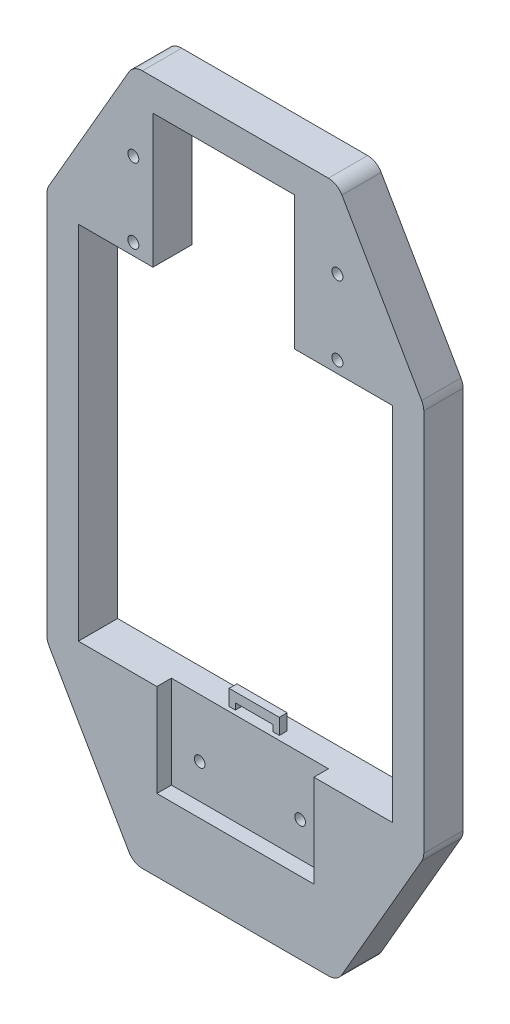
ISO-10303-21;
HEADER;
FILE_DESCRIPTION(('STEP AP214'),'2;1');
FILE_NAME('part.step','',(''),(''),'','','');
FILE_SCHEMA(('AUTOMOTIVE_DESIGN { 1 0 10303 214 1 1 1 1 }'));
ENDSEC;
DATA;
#1=APPLICATION_CONTEXT('core data for automotive mechanical design processes');
#2=APPLICATION_PROTOCOL_DEFINITION('international standard','automotive_design',2000,#1);
#3=PRODUCT_CONTEXT('',#1,'mechanical');
#4=PRODUCT('Part','Part','',(#3));
#5=PRODUCT_RELATED_PRODUCT_CATEGORY('part','',(#4));
#6=PRODUCT_DEFINITION_FORMATION('','',#4);
#7=PRODUCT_DEFINITION_CONTEXT('part definition',#1,'design');
#8=PRODUCT_DEFINITION('design','',#6,#7);
#9=PRODUCT_DEFINITION_SHAPE('','',#8);
#10=(LENGTH_UNIT() NAMED_UNIT(*) SI_UNIT(.MILLI.,.METRE.));
#11=(NAMED_UNIT(*) PLANE_ANGLE_UNIT() SI_UNIT($,.RADIAN.));
#12=(NAMED_UNIT(*) SI_UNIT($,.STERADIAN.) SOLID_ANGLE_UNIT());
#13=UNCERTAINTY_MEASURE_WITH_UNIT(LENGTH_MEASURE(1.E-05),#10,'distance_accuracy_value','');
#14=(GEOMETRIC_REPRESENTATION_CONTEXT(3) GLOBAL_UNCERTAINTY_ASSIGNED_CONTEXT((#13)) GLOBAL_UNIT_ASSIGNED_CONTEXT((#10,
#11,#12)) REPRESENTATION_CONTEXT('',''));
#15=CARTESIAN_POINT('',(0.,0.,0.));
#16=DIRECTION('',(0.,0.,1.));
#17=DIRECTION('',(1.,0.,0.));
#18=AXIS2_PLACEMENT_3D('',#15,#16,#17);
#19=CARTESIAN_POINT('',(-118.660254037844,127.025650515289,30.));
#20=DIRECTION('',(0.866025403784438,-0.500000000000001,0.));
#21=DIRECTION('',(0.500000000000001,0.866025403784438,0.));
#22=AXIS2_PLACEMENT_3D('',#19,#20,#21);
#23=PLANE('',#22);
#24=DIRECTION('',(0.500000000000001,0.866025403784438,0.));
#25=VECTOR('',#24,1.);
#26=CARTESIAN_POINT('',(-118.660254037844,127.025650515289,4.99999999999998));
#27=LINE('',#26,#25);
#28=CARTESIAN_POINT('',(-118.660254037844,127.025650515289,5.));
#29=VERTEX_POINT('',#28);
#30=CARTESIAN_POINT('',(-67.8682396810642,215.,5.));
#31=VERTEX_POINT('',#30);
#32=EDGE_CURVE('E467',#29,#31,#27,.T.);
#33=ORIENTED_EDGE('',*,*,#32,.F.);
#34=DIRECTION('',(0.,0.,-1.));
#35=VECTOR('',#34,1.);
#36=CARTESIAN_POINT('',(-118.660254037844,127.025650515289,30.));
#37=LINE('',#36,#35);
#38=CARTESIAN_POINT('',(-118.660254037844,127.025650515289,30.));
#39=VERTEX_POINT('',#38);
#40=EDGE_CURVE('E581',#39,#29,#37,.T.);
#41=ORIENTED_EDGE('',*,*,#40,.F.);
#42=DIRECTION('',(-0.500000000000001,-0.866025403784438,0.));
#43=VECTOR('',#42,1.);
#44=CARTESIAN_POINT('',(-118.660254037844,127.025650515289,30.));
#45=LINE('',#44,#43);
#46=CARTESIAN_POINT('',(-67.8682396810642,215.,30.));
#47=VERTEX_POINT('',#46);
#48=EDGE_CURVE('E564',#47,#39,#45,.T.);
#49=ORIENTED_EDGE('',*,*,#48,.F.);
#50=DIRECTION('',(0.,0.,-1.));
#51=VECTOR('',#50,1.);
#52=CARTESIAN_POINT('',(-67.8682396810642,215.,30.));
#53=LINE('',#52,#51);
#54=EDGE_CURVE('E585',#47,#31,#53,.T.);
#55=ORIENTED_EDGE('',*,*,#54,.T.);
#56=EDGE_LOOP('',(#33,#41,#49,#55));
#57=FACE_BOUND('',#56,.T.);
#58=ADVANCED_FACE('F43',(#57),#23,.F.);
#59=CARTESIAN_POINT('',(-110.,-122.025650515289,30.));
#60=DIRECTION('',(0.,0.,-1.));
#61=DIRECTION('',(-1.,0.,0.));
#62=AXIS2_PLACEMENT_3D('',#59,#60,#61);
#63=CYLINDRICAL_SURFACE('',#62,9.99999999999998);
#64=CARTESIAN_POINT('',(-110.,-122.025650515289,5.));
#65=DIRECTION('',(0.,0.,-1.));
#66=DIRECTION('',(-1.,0.,0.));
#67=AXIS2_PLACEMENT_3D('',#64,#65,#66);
#68=CIRCLE('',#67,9.99999999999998);
#69=CARTESIAN_POINT('',(-118.660254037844,-127.025650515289,5.));
#70=VERTEX_POINT('',#69);
#71=CARTESIAN_POINT('',(-120.,-122.025650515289,5.));
#72=VERTEX_POINT('',#71);
#73=EDGE_CURVE('E723',#70,#72,#68,.T.);
#74=ORIENTED_EDGE('',*,*,#73,.F.);
#75=DIRECTION('',(0.,0.,-1.));
#76=VECTOR('',#75,1.);
#77=CARTESIAN_POINT('',(-118.660254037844,-127.025650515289,30.));
#78=LINE('',#77,#76);
#79=CARTESIAN_POINT('',(-118.660254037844,-127.025650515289,30.));
#80=VERTEX_POINT('',#79);
#81=EDGE_CURVE('E633',#80,#70,#78,.T.);
#82=ORIENTED_EDGE('',*,*,#81,.F.);
#83=CARTESIAN_POINT('',(-110.,-122.025650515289,30.));
#84=DIRECTION('',(0.,0.,1.));
#85=DIRECTION('',(-1.,0.,0.));
#86=AXIS2_PLACEMENT_3D('',#83,#84,#85);
#87=CIRCLE('',#86,9.99999999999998);
#88=CARTESIAN_POINT('',(-120.,-122.025650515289,30.));
#89=VERTEX_POINT('',#88);
#90=EDGE_CURVE('E524',#89,#80,#87,.T.);
#91=ORIENTED_EDGE('',*,*,#90,.F.);
#92=DIRECTION('',(0.,0.,-1.));
#93=VECTOR('',#92,1.);
#94=CARTESIAN_POINT('',(-120.,-122.025650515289,30.));
#95=LINE('',#94,#93);
#96=EDGE_CURVE('E573',#89,#72,#95,.T.);
#97=ORIENTED_EDGE('',*,*,#96,.T.);
#98=EDGE_LOOP('',(#74,#82,#91,#97));
#99=FACE_BOUND('',#98,.T.);
#100=ADVANCED_FACE('F45',(#99),#63,.T.);
#101=CARTESIAN_POINT('',(-118.660254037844,-127.025650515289,30.));
#102=DIRECTION('',(0.866025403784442,0.499999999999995,0.));
#103=DIRECTION('',(-0.499999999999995,0.866025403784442,0.));
#104=AXIS2_PLACEMENT_3D('',#101,#102,#103);
#105=PLANE('',#104);
#106=ORIENTED_EDGE('',*,*,#81,.T.);
#107=DIRECTION('',(0.499999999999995,-0.866025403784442,0.));
#108=VECTOR('',#107,1.);
#109=CARTESIAN_POINT('',(-118.660254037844,-127.025650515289,4.99999999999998));
#110=LINE('',#109,#108);
#111=CARTESIAN_POINT('',(-67.8682396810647,-215.,5.));
#112=VERTEX_POINT('',#111);
#113=EDGE_CURVE('E422',#70,#112,#110,.T.);
#114=ORIENTED_EDGE('',*,*,#113,.T.);
#115=DIRECTION('',(0.,0.,-1.));
#116=VECTOR('',#115,1.);
#117=CARTESIAN_POINT('',(-67.8682396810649,-215.,30.));
#118=LINE('',#117,#116);
#119=CARTESIAN_POINT('',(-67.8682396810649,-215.,30.));
#120=VERTEX_POINT('',#119);
#121=EDGE_CURVE('E629',#120,#112,#118,.T.);
#122=ORIENTED_EDGE('',*,*,#121,.F.);
#123=DIRECTION('',(0.499999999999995,-0.866025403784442,0.));
#124=VECTOR('',#123,1.);
#125=CARTESIAN_POINT('',(-118.660254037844,-127.025650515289,30.));
#126=LINE('',#125,#124);
#127=EDGE_CURVE('E528',#80,#120,#126,.T.);
#128=ORIENTED_EDGE('',*,*,#127,.F.);
#129=EDGE_LOOP('',(#106,#114,#122,#128));
#130=FACE_BOUND('',#129,.T.);
#131=ADVANCED_FACE('F902',(#130),#105,.F.);
#132=CARTESIAN_POINT('',(-110.,122.025650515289,30.));
#133=DIRECTION('',(0.,0.,-1.));
#134=DIRECTION('',(-1.,0.,0.));
#135=AXIS2_PLACEMENT_3D('',#132,#133,#134);
#136=CYLINDRICAL_SURFACE('',#135,10.);
#137=CARTESIAN_POINT('',(-110.,122.025650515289,5.));
#138=DIRECTION('',(0.,0.,-1.));
#139=DIRECTION('',(-1.,0.,0.));
#140=AXIS2_PLACEMENT_3D('',#137,#138,#139);
#141=CIRCLE('',#140,10.);
#142=CARTESIAN_POINT('',(-120.,122.025650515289,5.));
#143=VERTEX_POINT('',#142);
#144=EDGE_CURVE('E716',#143,#29,#141,.T.);
#145=ORIENTED_EDGE('',*,*,#144,.F.);
#146=DIRECTION('',(0.,0.,-1.));
#147=VECTOR('',#146,1.);
#148=CARTESIAN_POINT('',(-120.,122.025650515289,30.));
#149=LINE('',#148,#147);
#150=CARTESIAN_POINT('',(-120.,122.025650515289,30.));
#151=VERTEX_POINT('',#150);
#152=EDGE_CURVE('E577',#151,#143,#149,.T.);
#153=ORIENTED_EDGE('',*,*,#152,.F.);
#154=CARTESIAN_POINT('',(-110.,122.025650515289,30.));
#155=DIRECTION('',(0.,0.,1.));
#156=DIRECTION('',(1.,0.,0.));
#157=AXIS2_PLACEMENT_3D('',#154,#155,#156);
#158=CIRCLE('',#157,10.);
#159=EDGE_CURVE('E567',#39,#151,#158,.T.);
#160=ORIENTED_EDGE('',*,*,#159,.F.);
#161=ORIENTED_EDGE('',*,*,#40,.T.);
#162=EDGE_LOOP('',(#145,#153,#160,#161));
#163=FACE_BOUND('',#162,.T.);
#164=ADVANCED_FACE('F906',(#163),#136,.T.);
#165=CARTESIAN_POINT('',(-120.,122.025650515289,30.));
#166=DIRECTION('',(1.,0.,0.));
#167=DIRECTION('',(0.,1.,0.));
#168=AXIS2_PLACEMENT_3D('',#165,#166,#167);
#169=PLANE('',#168);
#170=DIRECTION('',(0.,1.,0.));
#171=VECTOR('',#170,1.);
#172=CARTESIAN_POINT('',(-120.,122.025650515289,5.));
#173=LINE('',#172,#171);
#174=EDGE_CURVE('E720',#72,#143,#173,.T.);
#175=ORIENTED_EDGE('',*,*,#174,.F.);
#176=ORIENTED_EDGE('',*,*,#96,.F.);
#177=DIRECTION('',(0.,-1.,0.));
#178=VECTOR('',#177,1.);
#179=CARTESIAN_POINT('',(-120.,122.025650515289,30.));
#180=LINE('',#179,#178);
#181=EDGE_CURVE('E570',#151,#89,#180,.T.);
#182=ORIENTED_EDGE('',*,*,#181,.F.);
#183=ORIENTED_EDGE('',*,*,#152,.T.);
#184=EDGE_LOOP('',(#175,#176,#182,#183));
#185=FACE_BOUND('',#184,.T.);
#186=ADVANCED_FACE('F956',(#185),#169,.F.);
#187=CARTESIAN_POINT('',(37.5,200.,-10.));
#188=DIRECTION('',(1.,0.,0.));
#189=DIRECTION('',(0.,1.,0.));
#190=AXIS2_PLACEMENT_3D('',#187,#188,#189);
#191=PLANE('',#190);
#192=DIRECTION('',(0.,1.,0.));
#193=VECTOR('',#192,1.);
#194=CARTESIAN_POINT('',(37.5,200.,5.));
#195=LINE('',#194,#193);
#196=CARTESIAN_POINT('',(37.5,115.,5.));
#197=VERTEX_POINT('',#196);
#198=CARTESIAN_POINT('',(37.5,200.,5.));
#199=VERTEX_POINT('',#198);
#200=EDGE_CURVE('E733',#197,#199,#195,.T.);
#201=ORIENTED_EDGE('',*,*,#200,.F.);
#202=DIRECTION('',(0.,0.,1.));
#203=VECTOR('',#202,1.);
#204=CARTESIAN_POINT('',(37.5,115.,-10.));
#205=LINE('',#204,#203);
#206=CARTESIAN_POINT('',(37.5,115.,30.));
#207=VERTEX_POINT('',#206);
#208=EDGE_CURVE('E495',#197,#207,#205,.T.);
#209=ORIENTED_EDGE('',*,*,#208,.T.);
#210=DIRECTION('',(0.,1.,0.));
#211=VECTOR('',#210,1.);
#212=CARTESIAN_POINT('',(37.5,200.,30.));
#213=LINE('',#212,#211);
#214=CARTESIAN_POINT('',(37.5,200.,30.));
#215=VERTEX_POINT('',#214);
#216=EDGE_CURVE('E487',#207,#215,#213,.T.);
#217=ORIENTED_EDGE('',*,*,#216,.T.);
#218=DIRECTION('',(0.,0.,1.));
#219=VECTOR('',#218,1.);
#220=CARTESIAN_POINT('',(37.5,200.,30.));
#221=LINE('',#220,#219);
#222=EDGE_CURVE('E52',#199,#215,#221,.T.);
#223=ORIENTED_EDGE('',*,*,#222,.F.);
#224=EDGE_LOOP('',(#201,#209,#217,#223));
#225=FACE_BOUND('',#224,.T.);
#226=ADVANCED_FACE('F774',(#225),#191,.F.);
#227=CARTESIAN_POINT('',(47.6609802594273,200.,30.));
#228=DIRECTION('',(0.,-1.,0.));
#229=DIRECTION('',(0.,0.,-1.));
#230=AXIS2_PLACEMENT_3D('',#227,#228,#229);
#231=PLANE('',#230);
#232=DIRECTION('',(0.,0.,1.));
#233=VECTOR('',#232,1.);
#234=CARTESIAN_POINT('',(-52.5,200.,-86.3133825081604));
#235=LINE('',#234,#233);
#236=CARTESIAN_POINT('',(-52.5,200.,5.));
#237=VERTEX_POINT('',#236);
#238=CARTESIAN_POINT('',(-52.5,200.,30.));
#239=VERTEX_POINT('',#238);
#240=EDGE_CURVE('E316',#237,#239,#235,.T.);
#241=ORIENTED_EDGE('',*,*,#240,.F.);
#242=DIRECTION('',(1.,0.,0.));
#243=VECTOR('',#242,1.);
#244=CARTESIAN_POINT('',(47.6609802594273,200.,5.));
#245=LINE('',#244,#243);
#246=EDGE_CURVE('E66',#237,#199,#245,.T.);
#247=ORIENTED_EDGE('',*,*,#246,.T.);
#248=ORIENTED_EDGE('',*,*,#222,.T.);
#249=DIRECTION('',(-1.,0.,0.));
#250=VECTOR('',#249,1.);
#251=CARTESIAN_POINT('',(47.6609802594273,200.,30.));
#252=LINE('',#251,#250);
#253=EDGE_CURVE('E516',#215,#239,#252,.T.);
#254=ORIENTED_EDGE('',*,*,#253,.T.);
#255=EDGE_LOOP('',(#241,#247,#248,#254));
#256=FACE_BOUND('',#255,.T.);
#257=ADVANCED_FACE('F777',(#256),#231,.T.);
#258=CARTESIAN_POINT('',(118.660254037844,127.025650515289,30.));
#259=DIRECTION('',(-0.866025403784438,-0.500000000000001,0.));
#260=DIRECTION('',(0.500000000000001,-0.866025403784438,0.));
#261=AXIS2_PLACEMENT_3D('',#258,#259,#260);
#262=PLANE('',#261);
#263=DIRECTION('',(0.,0.,-1.));
#264=VECTOR('',#263,1.);
#265=CARTESIAN_POINT('',(118.660254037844,127.025650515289,30.));
#266=LINE('',#265,#264);
#267=CARTESIAN_POINT('',(118.660254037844,127.025650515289,30.));
#268=VERTEX_POINT('',#267);
#269=CARTESIAN_POINT('',(118.660254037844,127.025650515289,5.));
#270=VERTEX_POINT('',#269);
#271=EDGE_CURVE('E601',#268,#270,#266,.T.);
#272=ORIENTED_EDGE('',*,*,#271,.T.);
#273=DIRECTION('',(0.500000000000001,-0.866025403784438,0.));
#274=VECTOR('',#273,1.);
#275=CARTESIAN_POINT('',(118.660254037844,127.025650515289,4.99999999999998));
#276=LINE('',#275,#274);
#277=CARTESIAN_POINT('',(67.8682396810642,215.,5.));
#278=VERTEX_POINT('',#277);
#279=EDGE_CURVE('E59',#278,#270,#276,.T.);
#280=ORIENTED_EDGE('',*,*,#279,.F.);
#281=DIRECTION('',(0.,0.,-1.));
#282=VECTOR('',#281,1.);
#283=CARTESIAN_POINT('',(67.8682396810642,215.,30.));
#284=LINE('',#283,#282);
#285=CARTESIAN_POINT('',(67.8682396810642,215.,30.));
#286=VERTEX_POINT('',#285);
#287=EDGE_CURVE('E597',#286,#278,#284,.T.);
#288=ORIENTED_EDGE('',*,*,#287,.F.);
#289=DIRECTION('',(-0.500000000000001,0.866025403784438,0.));
#290=VECTOR('',#289,1.);
#291=CARTESIAN_POINT('',(118.660254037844,127.025650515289,30.));
#292=LINE('',#291,#290);
#293=EDGE_CURVE('E552',#268,#286,#292,.T.);
#294=ORIENTED_EDGE('',*,*,#293,.F.);
#295=EDGE_LOOP('',(#272,#280,#288,#294));
#296=FACE_BOUND('',#295,.T.);
#297=ADVANCED_FACE('F921',(#296),#262,.F.);
#298=CARTESIAN_POINT('',(99.9999999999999,116.666666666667,30.));
#299=DIRECTION('',(-1.,0.,0.));
#300=DIRECTION('',(0.,-1.,0.));
#301=AXIS2_PLACEMENT_3D('',#298,#299,#300);
#302=PLANE('',#301);
#303=DIRECTION('',(0.,0.,1.));
#304=VECTOR('',#303,1.);
#305=CARTESIAN_POINT('',(100.,115.,-10.));
#306=LINE('',#305,#304);
#307=CARTESIAN_POINT('',(99.9999999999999,115.,5.));
#308=VERTEX_POINT('',#307);
#309=CARTESIAN_POINT('',(99.9999999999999,115.,30.));
#310=VERTEX_POINT('',#309);
#311=EDGE_CURVE('E496',#308,#310,#306,.T.);
#312=ORIENTED_EDGE('',*,*,#311,.F.);
#313=DIRECTION('',(0.,-1.,0.));
#314=VECTOR('',#313,1.);
#315=CARTESIAN_POINT('',(99.9999999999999,116.666666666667,5.));
#316=LINE('',#315,#314);
#317=CARTESIAN_POINT('',(100.,-115.,5.));
#318=VERTEX_POINT('',#317);
#319=EDGE_CURVE('E726',#308,#318,#316,.T.);
#320=ORIENTED_EDGE('',*,*,#319,.T.);
#321=DIRECTION('',(0.,0.,1.));
#322=VECTOR('',#321,1.);
#323=CARTESIAN_POINT('',(100.,-115.,-10.));
#324=LINE('',#323,#322);
#325=CARTESIAN_POINT('',(100.,-115.,30.));
#326=VERTEX_POINT('',#325);
#327=EDGE_CURVE('E484',#318,#326,#324,.T.);
#328=ORIENTED_EDGE('',*,*,#327,.T.);
#329=DIRECTION('',(0.,1.,0.));
#330=VECTOR('',#329,1.);
#331=CARTESIAN_POINT('',(99.9999999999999,116.666666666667,30.));
#332=LINE('',#331,#330);
#333=EDGE_CURVE('E512',#326,#310,#332,.T.);
#334=ORIENTED_EDGE('',*,*,#333,.T.);
#335=EDGE_LOOP('',(#312,#320,#328,#334));
#336=FACE_BOUND('',#335,.T.);
#337=ADVANCED_FACE('F752',(#336),#302,.T.);
#338=CARTESIAN_POINT('',(-100.,116.666666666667,30.));
#339=DIRECTION('',(1.,0.,0.));
#340=DIRECTION('',(0.,1.,0.));
#341=AXIS2_PLACEMENT_3D('',#338,#339,#340);
#342=PLANE('',#341);
#343=DIRECTION('',(0.,0.,1.));
#344=VECTOR('',#343,1.);
#345=CARTESIAN_POINT('',(-100.,-115.,-10.));
#346=LINE('',#345,#344);
#347=CARTESIAN_POINT('',(-100.,-115.,5.));
#348=VERTEX_POINT('',#347);
#349=CARTESIAN_POINT('',(-100.,-115.,30.));
#350=VERTEX_POINT('',#349);
#351=EDGE_CURVE('E506',#348,#350,#346,.T.);
#352=ORIENTED_EDGE('',*,*,#351,.F.);
#353=DIRECTION('',(0.,1.,0.));
#354=VECTOR('',#353,1.);
#355=CARTESIAN_POINT('',(-100.,116.666666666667,5.));
#356=LINE('',#355,#354);
#357=CARTESIAN_POINT('',(-100.,115.,5.));
#358=VERTEX_POINT('',#357);
#359=EDGE_CURVE('E307',#348,#358,#356,.T.);
#360=ORIENTED_EDGE('',*,*,#359,.T.);
#361=DIRECTION('',(0.,0.,-1.));
#362=VECTOR('',#361,1.);
#363=CARTESIAN_POINT('',(-100.,115.,30.));
#364=LINE('',#363,#362);
#365=CARTESIAN_POINT('',(-100.,115.,30.));
#366=VERTEX_POINT('',#365);
#367=EDGE_CURVE('E305',#366,#358,#364,.T.);
#368=ORIENTED_EDGE('',*,*,#367,.F.);
#369=DIRECTION('',(0.,-1.,0.));
#370=VECTOR('',#369,1.);
#371=CARTESIAN_POINT('',(-100.,116.666666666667,30.));
#372=LINE('',#371,#370);
#373=EDGE_CURVE('E520',#366,#350,#372,.T.);
#374=ORIENTED_EDGE('',*,*,#373,.T.);
#375=EDGE_LOOP('',(#352,#360,#368,#374));
#376=FACE_BOUND('',#375,.T.);
#377=ADVANCED_FACE('F742',(#376),#342,.T.);
#378=CARTESIAN_POINT('',(118.660254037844,-127.025650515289,30.));
#379=DIRECTION('',(-0.866025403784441,0.499999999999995,0.));
#380=DIRECTION('',(-0.499999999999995,-0.866025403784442,0.));
#381=AXIS2_PLACEMENT_3D('',#378,#379,#380);
#382=PLANE('',#381);
#383=DIRECTION('',(0.499999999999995,0.866025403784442,0.));
#384=VECTOR('',#383,1.);
#385=CARTESIAN_POINT('',(118.660254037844,-127.025650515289,4.99999999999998));
#386=LINE('',#385,#384);
#387=CARTESIAN_POINT('',(67.8682396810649,-215.,5.));
#388=VERTEX_POINT('',#387);
#389=CARTESIAN_POINT('',(118.660254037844,-127.025650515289,5.));
#390=VERTEX_POINT('',#389);
#391=EDGE_CURVE('E398',#388,#390,#386,.T.);
#392=ORIENTED_EDGE('',*,*,#391,.T.);
#393=DIRECTION('',(0.,0.,-1.));
#394=VECTOR('',#393,1.);
#395=CARTESIAN_POINT('',(118.660254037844,-127.025650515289,30.));
#396=LINE('',#395,#394);
#397=CARTESIAN_POINT('',(118.660254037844,-127.025650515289,30.));
#398=VERTEX_POINT('',#397);
#399=EDGE_CURVE('E613',#398,#390,#396,.T.);
#400=ORIENTED_EDGE('',*,*,#399,.F.);
#401=DIRECTION('',(0.499999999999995,0.866025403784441,0.));
#402=VECTOR('',#401,1.);
#403=CARTESIAN_POINT('',(118.660254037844,-127.025650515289,30.));
#404=LINE('',#403,#402);
#405=CARTESIAN_POINT('',(67.8682396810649,-215.,30.));
#406=VERTEX_POINT('',#405);
#407=EDGE_CURVE('E540',#406,#398,#404,.T.);
#408=ORIENTED_EDGE('',*,*,#407,.F.);
#409=DIRECTION('',(0.,0.,-1.));
#410=VECTOR('',#409,1.);
#411=CARTESIAN_POINT('',(67.8682396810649,-215.,30.));
#412=LINE('',#411,#410);
#413=EDGE_CURVE('E617',#406,#388,#412,.T.);
#414=ORIENTED_EDGE('',*,*,#413,.T.);
#415=EDGE_LOOP('',(#392,#400,#408,#414));
#416=FACE_BOUND('',#415,.T.);
#417=ADVANCED_FACE('F936',(#416),#382,.F.);
#418=CARTESIAN_POINT('',(110.,-122.025650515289,30.));
#419=DIRECTION('',(0.,0.,-1.));
#420=DIRECTION('',(-1.,0.,0.));
#421=AXIS2_PLACEMENT_3D('',#418,#419,#420);
#422=CYLINDRICAL_SURFACE('',#421,9.99999999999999);
#423=CARTESIAN_POINT('',(110.,-122.025650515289,5.));
#424=DIRECTION('',(0.,0.,-1.));
#425=DIRECTION('',(-1.,0.,0.));
#426=AXIS2_PLACEMENT_3D('',#423,#424,#425);
#427=CIRCLE('',#426,9.99999999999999);
#428=CARTESIAN_POINT('',(120.,-122.025650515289,5.));
#429=VERTEX_POINT('',#428);
#430=EDGE_CURVE('E691',#429,#390,#427,.T.);
#431=ORIENTED_EDGE('',*,*,#430,.F.);
#432=DIRECTION('',(0.,0.,-1.));
#433=VECTOR('',#432,1.);
#434=CARTESIAN_POINT('',(120.,-122.025650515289,30.));
#435=LINE('',#434,#433);
#436=CARTESIAN_POINT('',(120.,-122.025650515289,30.));
#437=VERTEX_POINT('',#436);
#438=EDGE_CURVE('E609',#437,#429,#435,.T.);
#439=ORIENTED_EDGE('',*,*,#438,.F.);
#440=CARTESIAN_POINT('',(110.,-122.025650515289,30.));
#441=DIRECTION('',(0.,0.,1.));
#442=DIRECTION('',(-1.,0.,0.));
#443=AXIS2_PLACEMENT_3D('',#440,#441,#442);
#444=CIRCLE('',#443,9.99999999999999);
#445=EDGE_CURVE('E543',#398,#437,#444,.T.);
#446=ORIENTED_EDGE('',*,*,#445,.F.);
#447=ORIENTED_EDGE('',*,*,#399,.T.);
#448=EDGE_LOOP('',(#431,#439,#446,#447));
#449=FACE_BOUND('',#448,.T.);
#450=ADVANCED_FACE('F932',(#449),#422,.T.);
#451=CARTESIAN_POINT('',(120.,122.025650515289,30.));
#452=DIRECTION('',(-1.,0.,0.));
#453=DIRECTION('',(0.,-1.,0.));
#454=AXIS2_PLACEMENT_3D('',#451,#452,#453);
#455=PLANE('',#454);
#456=DIRECTION('',(0.,-1.,0.));
#457=VECTOR('',#456,1.);
#458=CARTESIAN_POINT('',(120.,122.025650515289,5.));
#459=LINE('',#458,#457);
#460=CARTESIAN_POINT('',(120.,122.025650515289,5.));
#461=VERTEX_POINT('',#460);
#462=EDGE_CURVE('E710',#461,#429,#459,.T.);
#463=ORIENTED_EDGE('',*,*,#462,.F.);
#464=DIRECTION('',(0.,0.,-1.));
#465=VECTOR('',#464,1.);
#466=CARTESIAN_POINT('',(120.,122.025650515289,30.));
#467=LINE('',#466,#465);
#468=CARTESIAN_POINT('',(120.,122.025650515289,30.));
#469=VERTEX_POINT('',#468);
#470=EDGE_CURVE('E605',#469,#461,#467,.T.);
#471=ORIENTED_EDGE('',*,*,#470,.F.);
#472=DIRECTION('',(0.,1.,0.));
#473=VECTOR('',#472,1.);
#474=CARTESIAN_POINT('',(120.,122.025650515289,30.));
#475=LINE('',#474,#473);
#476=EDGE_CURVE('E546',#437,#469,#475,.T.);
#477=ORIENTED_EDGE('',*,*,#476,.F.);
#478=ORIENTED_EDGE('',*,*,#438,.T.);
#479=EDGE_LOOP('',(#463,#471,#477,#478));
#480=FACE_BOUND('',#479,.T.);
#481=ADVANCED_FACE('F928',(#480),#455,.F.);
#482=CARTESIAN_POINT('',(110.,122.025650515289,30.));
#483=DIRECTION('',(0.,0.,-1.));
#484=DIRECTION('',(-1.,0.,0.));
#485=AXIS2_PLACEMENT_3D('',#482,#483,#484);
#486=CYLINDRICAL_SURFACE('',#485,10.);
#487=CARTESIAN_POINT('',(110.,122.025650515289,5.));
#488=DIRECTION('',(0.,0.,-1.));
#489=DIRECTION('',(-1.,0.,0.));
#490=AXIS2_PLACEMENT_3D('',#487,#488,#489);
#491=CIRCLE('',#490,10.);
#492=EDGE_CURVE('E713',#270,#461,#491,.T.);
#493=ORIENTED_EDGE('',*,*,#492,.F.);
#494=ORIENTED_EDGE('',*,*,#271,.F.);
#495=CARTESIAN_POINT('',(110.,122.025650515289,30.));
#496=DIRECTION('',(0.,0.,1.));
#497=DIRECTION('',(-1.,0.,0.));
#498=AXIS2_PLACEMENT_3D('',#495,#496,#497);
#499=CIRCLE('',#498,10.);
#500=EDGE_CURVE('E549',#469,#268,#499,.T.);
#501=ORIENTED_EDGE('',*,*,#500,.F.);
#502=ORIENTED_EDGE('',*,*,#470,.T.);
#503=EDGE_LOOP('',(#493,#494,#501,#502));
#504=FACE_BOUND('',#503,.T.);
#505=ADVANCED_FACE('F925',(#504),#486,.T.);
#506=CARTESIAN_POINT('',(-37.5,115.,-10.));
#507=DIRECTION('',(0.,-1.,0.));
#508=DIRECTION('',(0.,0.,-1.));
#509=AXIS2_PLACEMENT_3D('',#506,#507,#508);
#510=PLANE('',#509);
#511=ORIENTED_EDGE('',*,*,#367,.T.);
#512=DIRECTION('',(1.,0.,0.));
#513=VECTOR('',#512,1.);
#514=CARTESIAN_POINT('',(-37.5,115.,5.));
#515=LINE('',#514,#513);
#516=CARTESIAN_POINT('',(-52.5,115.,5.));
#517=VERTEX_POINT('',#516);
#518=EDGE_CURVE('E293',#358,#517,#515,.T.);
#519=ORIENTED_EDGE('',*,*,#518,.T.);
#520=DIRECTION('',(0.,0.,1.));
#521=VECTOR('',#520,1.);
#522=CARTESIAN_POINT('',(-52.5,115.,-86.3133825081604));
#523=LINE('',#522,#521);
#524=CARTESIAN_POINT('',(-52.5,115.,30.));
#525=VERTEX_POINT('',#524);
#526=EDGE_CURVE('E302',#517,#525,#523,.T.);
#527=ORIENTED_EDGE('',*,*,#526,.T.);
#528=DIRECTION('',(1.,0.,0.));
#529=VECTOR('',#528,1.);
#530=CARTESIAN_POINT('',(-37.5,115.,30.));
#531=LINE('',#530,#529);
#532=EDGE_CURVE('E509',#366,#525,#531,.T.);
#533=ORIENTED_EDGE('',*,*,#532,.F.);
#534=EDGE_LOOP('',(#511,#519,#527,#533));
#535=FACE_BOUND('',#534,.T.);
#536=ADVANCED_FACE('F300',(#535),#510,.T.);
#537=ORIENTED_EDGE('',*,*,#208,.F.);
#538=EDGE_CURVE('E309',#197,#308,#515,.T.);
#539=ORIENTED_EDGE('',*,*,#538,.T.);
#540=ORIENTED_EDGE('',*,*,#311,.T.);
#541=DIRECTION('',(-1.,0.,0.));
#542=VECTOR('',#541,1.);
#543=CARTESIAN_POINT('',(37.5,115.,30.));
#544=LINE('',#543,#542);
#545=EDGE_CURVE('E491',#310,#207,#544,.T.);
#546=ORIENTED_EDGE('',*,*,#545,.T.);
#547=EDGE_LOOP('',(#537,#539,#540,#546));
#548=FACE_BOUND('',#547,.T.);
#549=ADVANCED_FACE('F758',(#548),#510,.T.);
#550=CARTESIAN_POINT('',(-37.5,-115.,-10.));
#551=DIRECTION('',(0.,-1.,0.));
#552=DIRECTION('',(0.,0.,-1.));
#553=AXIS2_PLACEMENT_3D('',#550,#551,#552);
#554=PLANE('',#553);
#555=DIRECTION('',(0.,0.,1.));
#556=VECTOR('',#555,1.);
#557=CARTESIAN_POINT('',(12.,-115.,13.));
#558=LINE('',#557,#556);
#559=CARTESIAN_POINT('',(12.,-115.,13.));
#560=VERTEX_POINT('',#559);
#561=CARTESIAN_POINT('',(12.,-115.,18.));
#562=VERTEX_POINT('',#561);
#563=EDGE_CURVE('E408',#560,#562,#558,.T.);
#564=ORIENTED_EDGE('',*,*,#563,.F.);
#565=DIRECTION('',(1.,0.,0.));
#566=VECTOR('',#565,1.);
#567=CARTESIAN_POINT('',(12.,-115.,13.));
#568=LINE('',#567,#566);
#569=CARTESIAN_POINT('',(16.,-115.,13.));
#570=VERTEX_POINT('',#569);
#571=EDGE_CURVE('E348',#560,#570,#568,.T.);
#572=ORIENTED_EDGE('',*,*,#571,.T.);
#573=DIRECTION('',(0.,0.,1.));
#574=VECTOR('',#573,1.);
#575=CARTESIAN_POINT('',(16.,-115.,13.));
#576=LINE('',#575,#574);
#577=CARTESIAN_POINT('',(16.,-115.,18.));
#578=VERTEX_POINT('',#577);
#579=EDGE_CURVE('E405',#570,#578,#576,.T.);
#580=ORIENTED_EDGE('',*,*,#579,.T.);
#581=DIRECTION('',(1.,0.,0.));
#582=VECTOR('',#581,1.);
#583=CARTESIAN_POINT('',(12.,-115.,18.));
#584=LINE('',#583,#582);
#585=EDGE_CURVE('E379',#562,#578,#584,.T.);
#586=ORIENTED_EDGE('',*,*,#585,.F.);
#587=EDGE_LOOP('',(#564,#572,#580,#586));
#588=FACE_BOUND('',#587,.T.);
#589=DIRECTION('',(0.,0.,1.));
#590=VECTOR('',#589,1.);
#591=CARTESIAN_POINT('',(-16.,-115.,13.));
#592=LINE('',#591,#590);
#593=CARTESIAN_POINT('',(-16.,-115.,13.));
#594=VERTEX_POINT('',#593);
#595=CARTESIAN_POINT('',(-16.,-115.,18.));
#596=VERTEX_POINT('',#595);
#597=EDGE_CURVE('E394',#594,#596,#592,.T.);
#598=ORIENTED_EDGE('',*,*,#597,.F.);
#599=DIRECTION('',(1.,0.,0.));
#600=VECTOR('',#599,1.);
#601=CARTESIAN_POINT('',(-12.,-115.,13.));
#602=LINE('',#601,#600);
#603=CARTESIAN_POINT('',(-12.,-115.,13.));
#604=VERTEX_POINT('',#603);
#605=EDGE_CURVE('E332',#594,#604,#602,.T.);
#606=ORIENTED_EDGE('',*,*,#605,.T.);
#607=DIRECTION('',(0.,0.,1.));
#608=VECTOR('',#607,1.);
#609=CARTESIAN_POINT('',(-12.,-115.,13.));
#610=LINE('',#609,#608);
#611=CARTESIAN_POINT('',(-12.,-115.,18.));
#612=VERTEX_POINT('',#611);
#613=EDGE_CURVE('E363',#604,#612,#610,.T.);
#614=ORIENTED_EDGE('',*,*,#613,.T.);
#615=DIRECTION('',(1.,0.,0.));
#616=VECTOR('',#615,1.);
#617=CARTESIAN_POINT('',(-12.,-115.,18.));
#618=LINE('',#617,#616);
#619=EDGE_CURVE('E331',#596,#612,#618,.T.);
#620=ORIENTED_EDGE('',*,*,#619,.F.);
#621=EDGE_LOOP('',(#598,#606,#614,#620));
#622=FACE_BOUND('',#621,.T.);
#623=DIRECTION('',(1.,0.,0.));
#624=VECTOR('',#623,1.);
#625=CARTESIAN_POINT('',(-37.5,-115.,5.));
#626=LINE('',#625,#624);
#627=EDGE_CURVE('E730',#348,#318,#626,.T.);
#628=ORIENTED_EDGE('',*,*,#627,.F.);
#629=ORIENTED_EDGE('',*,*,#351,.T.);
#630=DIRECTION('',(1.,0.,0.));
#631=VECTOR('',#630,1.);
#632=CARTESIAN_POINT('',(-37.5,-115.,30.));
#633=LINE('',#632,#631);
#634=CARTESIAN_POINT('',(-50.,-115.,30.));
#635=VERTEX_POINT('',#634);
#636=EDGE_CURVE('E502',#350,#635,#633,.T.);
#637=ORIENTED_EDGE('',*,*,#636,.T.);
#638=DIRECTION('',(0.,0.,1.));
#639=VECTOR('',#638,1.);
#640=CARTESIAN_POINT('',(-50.,-115.,20.75));
#641=LINE('',#640,#639);
#642=CARTESIAN_POINT('',(-50.,-115.,20.75));
#643=VERTEX_POINT('',#642);
#644=EDGE_CURVE('E644',#643,#635,#641,.T.);
#645=ORIENTED_EDGE('',*,*,#644,.F.);
#646=DIRECTION('',(-1.,0.,0.));
#647=VECTOR('',#646,1.);
#648=CARTESIAN_POINT('',(-50.,-115.,20.75));
#649=LINE('',#648,#647);
#650=CARTESIAN_POINT('',(50.,-115.,20.75));
#651=VERTEX_POINT('',#650);
#652=EDGE_CURVE('E670',#651,#643,#649,.T.);
#653=ORIENTED_EDGE('',*,*,#652,.F.);
#654=DIRECTION('',(0.,0.,1.));
#655=VECTOR('',#654,1.);
#656=CARTESIAN_POINT('',(50.,-115.,20.75));
#657=LINE('',#656,#655);
#658=CARTESIAN_POINT('',(50.,-115.,30.));
#659=VERTEX_POINT('',#658);
#660=EDGE_CURVE('E651',#651,#659,#657,.T.);
#661=ORIENTED_EDGE('',*,*,#660,.T.);
#662=EDGE_CURVE('E499',#659,#326,#633,.T.);
#663=ORIENTED_EDGE('',*,*,#662,.T.);
#664=ORIENTED_EDGE('',*,*,#327,.F.);
#665=EDGE_LOOP('',(#628,#629,#637,#645,#653,#661,#663,#664));
#666=FACE_BOUND('',#665,.T.);
#667=ADVANCED_FACE('F746',(#588,#622,#666),#554,.F.);
#668=CARTESIAN_POINT('',(-52.5,200.,-86.3133825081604));
#669=DIRECTION('',(-1.,0.,0.));
#670=DIRECTION('',(0.,-1.,0.));
#671=AXIS2_PLACEMENT_3D('',#668,#669,#670);
#672=PLANE('',#671);
#673=DIRECTION('',(0.,-1.,0.));
#674=VECTOR('',#673,1.);
#675=CARTESIAN_POINT('',(-52.5,200.,5.));
#676=LINE('',#675,#674);
#677=EDGE_CURVE('E11',#237,#517,#676,.T.);
#678=ORIENTED_EDGE('',*,*,#677,.F.);
#679=ORIENTED_EDGE('',*,*,#240,.T.);
#680=DIRECTION('',(0.,-1.,0.));
#681=VECTOR('',#680,1.);
#682=CARTESIAN_POINT('',(-52.5,200.,30.));
#683=LINE('',#682,#681);
#684=EDGE_CURVE('E312',#239,#525,#683,.T.);
#685=ORIENTED_EDGE('',*,*,#684,.T.);
#686=ORIENTED_EDGE('',*,*,#526,.F.);
#687=EDGE_LOOP('',(#678,#679,#685,#686));
#688=FACE_BOUND('',#687,.T.);
#689=ADVANCED_FACE('F310',(#688),#672,.F.);
#690=CARTESIAN_POINT('',(-59.2079856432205,-210.,30.));
#691=DIRECTION('',(0.,0.,-1.));
#692=DIRECTION('',(-1.,0.,0.));
#693=AXIS2_PLACEMENT_3D('',#690,#691,#692);
#694=CYLINDRICAL_SURFACE('',#693,10.);
#695=CARTESIAN_POINT('',(-59.2079856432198,-210.,5.));
#696=DIRECTION('',(0.,0.,-1.));
#697=DIRECTION('',(-1.,0.,0.));
#698=AXIS2_PLACEMENT_3D('',#695,#696,#697);
#699=CIRCLE('',#698,10.);
#700=CARTESIAN_POINT('',(-59.2079856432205,-220.,5.));
#701=VERTEX_POINT('',#700);
#702=EDGE_CURVE('E429',#701,#112,#699,.T.);
#703=ORIENTED_EDGE('',*,*,#702,.F.);
#704=DIRECTION('',(0.,0.,-1.));
#705=VECTOR('',#704,1.);
#706=CARTESIAN_POINT('',(-59.2079856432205,-220.,30.));
#707=LINE('',#706,#705);
#708=CARTESIAN_POINT('',(-59.2079856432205,-220.,30.));
#709=VERTEX_POINT('',#708);
#710=EDGE_CURVE('E625',#709,#701,#707,.T.);
#711=ORIENTED_EDGE('',*,*,#710,.F.);
#712=CARTESIAN_POINT('',(-59.2079856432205,-210.,30.));
#713=DIRECTION('',(0.,0.,1.));
#714=DIRECTION('',(-1.,0.,0.));
#715=AXIS2_PLACEMENT_3D('',#712,#713,#714);
#716=CIRCLE('',#715,10.);
#717=EDGE_CURVE('E531',#120,#709,#716,.T.);
#718=ORIENTED_EDGE('',*,*,#717,.F.);
#719=ORIENTED_EDGE('',*,*,#121,.T.);
#720=EDGE_LOOP('',(#703,#711,#718,#719));
#721=FACE_BOUND('',#720,.T.);
#722=ADVANCED_FACE('F947',(#721),#694,.T.);
#723=CARTESIAN_POINT('',(59.2079856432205,-220.,30.));
#724=DIRECTION('',(0.,1.,0.));
#725=DIRECTION('',(0.,0.,1.));
#726=AXIS2_PLACEMENT_3D('',#723,#724,#725);
#727=PLANE('',#726);
#728=DIRECTION('',(-1.,0.,0.));
#729=VECTOR('',#728,1.);
#730=CARTESIAN_POINT('',(-59.2079856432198,-220.,5.));
#731=LINE('',#730,#729);
#732=CARTESIAN_POINT('',(59.2079856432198,-220.,5.));
#733=VERTEX_POINT('',#732);
#734=EDGE_CURVE('E432',#733,#701,#731,.T.);
#735=ORIENTED_EDGE('',*,*,#734,.F.);
#736=DIRECTION('',(0.,0.,-1.));
#737=VECTOR('',#736,1.);
#738=CARTESIAN_POINT('',(59.2079856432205,-220.,30.));
#739=LINE('',#738,#737);
#740=CARTESIAN_POINT('',(59.2079856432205,-220.,30.));
#741=VERTEX_POINT('',#740);
#742=EDGE_CURVE('E621',#741,#733,#739,.T.);
#743=ORIENTED_EDGE('',*,*,#742,.F.);
#744=DIRECTION('',(1.,0.,0.));
#745=VECTOR('',#744,1.);
#746=CARTESIAN_POINT('',(59.2079856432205,-220.,30.));
#747=LINE('',#746,#745);
#748=EDGE_CURVE('E534',#709,#741,#747,.T.);
#749=ORIENTED_EDGE('',*,*,#748,.F.);
#750=ORIENTED_EDGE('',*,*,#710,.T.);
#751=EDGE_LOOP('',(#735,#743,#749,#750));
#752=FACE_BOUND('',#751,.T.);
#753=ADVANCED_FACE('F943',(#752),#727,.F.);
#754=CARTESIAN_POINT('',(59.2079856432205,-210.,30.));
#755=DIRECTION('',(0.,0.,-1.));
#756=DIRECTION('',(-1.,0.,0.));
#757=AXIS2_PLACEMENT_3D('',#754,#755,#756);
#758=CYLINDRICAL_SURFACE('',#757,10.);
#759=CARTESIAN_POINT('',(59.2079856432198,-210.,5.));
#760=DIRECTION('',(0.,0.,-1.));
#761=DIRECTION('',(-1.,0.,0.));
#762=AXIS2_PLACEMENT_3D('',#759,#760,#761);
#763=CIRCLE('',#762,10.);
#764=EDGE_CURVE('E426',#388,#733,#763,.T.);
#765=ORIENTED_EDGE('',*,*,#764,.F.);
#766=ORIENTED_EDGE('',*,*,#413,.F.);
#767=CARTESIAN_POINT('',(59.2079856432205,-210.,30.));
#768=DIRECTION('',(0.,0.,1.));
#769=DIRECTION('',(-1.,0.,0.));
#770=AXIS2_PLACEMENT_3D('',#767,#768,#769);
#771=CIRCLE('',#770,10.);
#772=EDGE_CURVE('E537',#741,#406,#771,.T.);
#773=ORIENTED_EDGE('',*,*,#772,.F.);
#774=ORIENTED_EDGE('',*,*,#742,.T.);
#775=EDGE_LOOP('',(#765,#766,#773,#774));
#776=FACE_BOUND('',#775,.T.);
#777=ADVANCED_FACE('F919',(#776),#758,.T.);
#778=CARTESIAN_POINT('',(59.2079856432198,210.,30.));
#779=DIRECTION('',(0.,0.,-1.));
#780=DIRECTION('',(-1.,0.,0.));
#781=AXIS2_PLACEMENT_3D('',#778,#779,#780);
#782=CYLINDRICAL_SURFACE('',#781,10.);
#783=CARTESIAN_POINT('',(59.2079856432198,210.,5.));
#784=DIRECTION('',(0.,0.,1.));
#785=DIRECTION('',(-1.,0.,0.));
#786=AXIS2_PLACEMENT_3D('',#783,#784,#785);
#787=CIRCLE('',#786,10.);
#788=CARTESIAN_POINT('',(59.2079856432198,220.,5.));
#789=VERTEX_POINT('',#788);
#790=EDGE_CURVE('E472',#278,#789,#787,.T.);
#791=ORIENTED_EDGE('',*,*,#790,.T.);
#792=DIRECTION('',(0.,0.,-1.));
#793=VECTOR('',#792,1.);
#794=CARTESIAN_POINT('',(59.2079856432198,220.,30.));
#795=LINE('',#794,#793);
#796=CARTESIAN_POINT('',(59.2079856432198,220.,30.));
#797=VERTEX_POINT('',#796);
#798=EDGE_CURVE('E593',#797,#789,#795,.T.);
#799=ORIENTED_EDGE('',*,*,#798,.F.);
#800=CARTESIAN_POINT('',(59.2079856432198,210.,30.));
#801=DIRECTION('',(0.,0.,1.));
#802=DIRECTION('',(-1.,0.,0.));
#803=AXIS2_PLACEMENT_3D('',#800,#801,#802);
#804=CIRCLE('',#803,10.);
#805=EDGE_CURVE('E555',#286,#797,#804,.T.);
#806=ORIENTED_EDGE('',*,*,#805,.F.);
#807=ORIENTED_EDGE('',*,*,#287,.T.);
#808=EDGE_LOOP('',(#791,#799,#806,#807));
#809=FACE_BOUND('',#808,.T.);
#810=ADVANCED_FACE('F915',(#809),#782,.T.);
#811=CARTESIAN_POINT('',(59.2079856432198,220.,30.));
#812=DIRECTION('',(0.,-1.,0.));
#813=DIRECTION('',(0.,0.,-1.));
#814=AXIS2_PLACEMENT_3D('',#811,#812,#813);
#815=PLANE('',#814);
#816=DIRECTION('',(-1.,0.,0.));
#817=VECTOR('',#816,1.);
#818=CARTESIAN_POINT('',(-59.2079856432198,220.,5.));
#819=LINE('',#818,#817);
#820=CARTESIAN_POINT('',(-59.2079856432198,220.,5.));
#821=VERTEX_POINT('',#820);
#822=EDGE_CURVE('E476',#789,#821,#819,.T.);
#823=ORIENTED_EDGE('',*,*,#822,.T.);
#824=DIRECTION('',(0.,0.,-1.));
#825=VECTOR('',#824,1.);
#826=CARTESIAN_POINT('',(-59.2079856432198,220.,30.));
#827=LINE('',#826,#825);
#828=CARTESIAN_POINT('',(-59.2079856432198,220.,30.));
#829=VERTEX_POINT('',#828);
#830=EDGE_CURVE('E589',#829,#821,#827,.T.);
#831=ORIENTED_EDGE('',*,*,#830,.F.);
#832=DIRECTION('',(-1.,0.,0.));
#833=VECTOR('',#832,1.);
#834=CARTESIAN_POINT('',(59.2079856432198,220.,30.));
#835=LINE('',#834,#833);
#836=EDGE_CURVE('E558',#797,#829,#835,.T.);
#837=ORIENTED_EDGE('',*,*,#836,.F.);
#838=ORIENTED_EDGE('',*,*,#798,.T.);
#839=EDGE_LOOP('',(#823,#831,#837,#838));
#840=FACE_BOUND('',#839,.T.);
#841=ADVANCED_FACE('F911',(#840),#815,.F.);
#842=CARTESIAN_POINT('',(-59.2079856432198,210.,30.));
#843=DIRECTION('',(0.,0.,-1.));
#844=DIRECTION('',(-1.,0.,0.));
#845=AXIS2_PLACEMENT_3D('',#842,#843,#844);
#846=CYLINDRICAL_SURFACE('',#845,10.);
#847=CARTESIAN_POINT('',(-59.2079856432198,210.,5.));
#848=DIRECTION('',(0.,0.,1.));
#849=DIRECTION('',(-1.,0.,0.));
#850=AXIS2_PLACEMENT_3D('',#847,#848,#849);
#851=CIRCLE('',#850,10.);
#852=EDGE_CURVE('E480',#821,#31,#851,.T.);
#853=ORIENTED_EDGE('',*,*,#852,.T.);
#854=ORIENTED_EDGE('',*,*,#54,.F.);
#855=CARTESIAN_POINT('',(-59.2079856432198,210.,30.));
#856=DIRECTION('',(0.,0.,1.));
#857=DIRECTION('',(-1.,0.,0.));
#858=AXIS2_PLACEMENT_3D('',#855,#856,#857);
#859=CIRCLE('',#858,10.);
#860=EDGE_CURVE('E561',#829,#47,#859,.T.);
#861=ORIENTED_EDGE('',*,*,#860,.F.);
#862=ORIENTED_EDGE('',*,*,#830,.T.);
#863=EDGE_LOOP('',(#853,#854,#861,#862));
#864=FACE_BOUND('',#863,.T.);
#865=ADVANCED_FACE('F908',(#864),#846,.T.);
#866=CARTESIAN_POINT('',(-110.,-122.025650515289,30.));
#867=DIRECTION('',(0.,0.,-1.));
#868=DIRECTION('',(-1.,0.,0.));
#869=AXIS2_PLACEMENT_3D('',#866,#867,#868);
#870=PLANE('',#869);
#871=DIRECTION('',(1.,0.,0.));
#872=VECTOR('',#871,1.);
#873=CARTESIAN_POINT('',(-50.,-174.,30.));
#874=LINE('',#873,#872);
#875=CARTESIAN_POINT('',(-50.,-174.,30.));
#876=VERTEX_POINT('',#875);
#877=CARTESIAN_POINT('',(50.,-174.,30.));
#878=VERTEX_POINT('',#877);
#879=EDGE_CURVE('E690',#876,#878,#874,.T.);
#880=ORIENTED_EDGE('',*,*,#879,.F.);
#881=DIRECTION('',(0.,-1.,0.));
#882=VECTOR('',#881,1.);
#883=CARTESIAN_POINT('',(-50.,-115.,30.));
#884=LINE('',#883,#882);
#885=EDGE_CURVE('E688',#635,#876,#884,.T.);
#886=ORIENTED_EDGE('',*,*,#885,.F.);
#887=ORIENTED_EDGE('',*,*,#636,.F.);
#888=ORIENTED_EDGE('',*,*,#373,.F.);
#889=ORIENTED_EDGE('',*,*,#532,.T.);
#890=ORIENTED_EDGE('',*,*,#684,.F.);
#891=ORIENTED_EDGE('',*,*,#253,.F.);
#892=ORIENTED_EDGE('',*,*,#216,.F.);
#893=ORIENTED_EDGE('',*,*,#545,.F.);
#894=ORIENTED_EDGE('',*,*,#333,.F.);
#895=ORIENTED_EDGE('',*,*,#662,.F.);
#896=DIRECTION('',(0.,1.,0.));
#897=VECTOR('',#896,1.);
#898=CARTESIAN_POINT('',(50.,-115.,30.));
#899=LINE('',#898,#897);
#900=EDGE_CURVE('E663',#878,#659,#899,.T.);
#901=ORIENTED_EDGE('',*,*,#900,.F.);
#902=EDGE_LOOP('',(#880,#886,#887,#888,#889,#890,#891,#892,#893,#894,#895,#901));
#903=FACE_BOUND('',#902,.T.);
#904=CARTESIAN_POINT('',(65.,122.5,30.));
#905=DIRECTION('',(0.,0.,1.));
#906=DIRECTION('',(1.,0.,0.));
#907=AXIS2_PLACEMENT_3D('',#904,#905,#906);
#908=CIRCLE('',#907,3.5);
#909=CARTESIAN_POINT('',(68.5,122.5,30.));
#910=VERTEX_POINT('',#909);
#911=EDGE_CURVE('E435',#910,#910,#908,.T.);
#912=ORIENTED_EDGE('',*,*,#911,.F.);
#913=EDGE_LOOP('',(#912));
#914=FACE_BOUND('',#913,.T.);
#915=CARTESIAN_POINT('',(65.,170.,30.));
#916=DIRECTION('',(0.,0.,1.));
#917=DIRECTION('',(1.,0.,0.));
#918=AXIS2_PLACEMENT_3D('',#915,#916,#917);
#919=CIRCLE('',#918,3.5);
#920=CARTESIAN_POINT('',(68.5,170.,30.));
#921=VERTEX_POINT('',#920);
#922=EDGE_CURVE('E443',#921,#921,#919,.T.);
#923=ORIENTED_EDGE('',*,*,#922,.F.);
#924=EDGE_LOOP('',(#923));
#925=FACE_BOUND('',#924,.T.);
#926=CARTESIAN_POINT('',(-65.,122.5,30.));
#927=DIRECTION('',(0.,0.,1.));
#928=DIRECTION('',(1.,0.,0.));
#929=AXIS2_PLACEMENT_3D('',#926,#927,#928);
#930=CIRCLE('',#929,3.5);
#931=CARTESIAN_POINT('',(-61.5,122.5,30.));
#932=VERTEX_POINT('',#931);
#933=EDGE_CURVE('E451',#932,#932,#930,.T.);
#934=ORIENTED_EDGE('',*,*,#933,.F.);
#935=EDGE_LOOP('',(#934));
#936=FACE_BOUND('',#935,.T.);
#937=CARTESIAN_POINT('',(-65.,170.,30.));
#938=DIRECTION('',(0.,0.,1.));
#939=DIRECTION('',(1.,0.,0.));
#940=AXIS2_PLACEMENT_3D('',#937,#938,#939);
#941=CIRCLE('',#940,3.5);
#942=CARTESIAN_POINT('',(-61.5,170.,30.));
#943=VERTEX_POINT('',#942);
#944=EDGE_CURVE('E459',#943,#943,#941,.T.);
#945=ORIENTED_EDGE('',*,*,#944,.F.);
#946=EDGE_LOOP('',(#945));
#947=FACE_BOUND('',#946,.T.);
#948=ORIENTED_EDGE('',*,*,#90,.T.);
#949=ORIENTED_EDGE('',*,*,#127,.T.);
#950=ORIENTED_EDGE('',*,*,#717,.T.);
#951=ORIENTED_EDGE('',*,*,#748,.T.);
#952=ORIENTED_EDGE('',*,*,#772,.T.);
#953=ORIENTED_EDGE('',*,*,#407,.T.);
#954=ORIENTED_EDGE('',*,*,#445,.T.);
#955=ORIENTED_EDGE('',*,*,#476,.T.);
#956=ORIENTED_EDGE('',*,*,#500,.T.);
#957=ORIENTED_EDGE('',*,*,#293,.T.);
#958=ORIENTED_EDGE('',*,*,#805,.T.);
#959=ORIENTED_EDGE('',*,*,#836,.T.);
#960=ORIENTED_EDGE('',*,*,#860,.T.);
#961=ORIENTED_EDGE('',*,*,#48,.T.);
#962=ORIENTED_EDGE('',*,*,#159,.T.);
#963=ORIENTED_EDGE('',*,*,#181,.T.);
#964=EDGE_LOOP('',(#948,#949,#950,#951,#952,#953,#954,#955,#956,#957,#958,#959,#960,#961,#962,#963));
#965=FACE_BOUND('',#964,.T.);
#966=ADVANCED_FACE('F780',(#903,#914,#925,#936,#947,#965),#870,.F.);
#967=CARTESIAN_POINT('',(-65.,170.,9.));
#968=DIRECTION('',(0.,0.,1.));
#969=DIRECTION('',(1.,0.,0.));
#970=AXIS2_PLACEMENT_3D('',#967,#968,#969);
#971=CONICAL_SURFACE('',#970,3.5,1.02974425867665);
#972=CARTESIAN_POINT('',(-65.,170.,6.89698783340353));
#973=VERTEX_POINT('',#972);
#974=VERTEX_LOOP('',#973);
#975=FACE_BOUND('',#974,.T.);
#976=CARTESIAN_POINT('',(-65.,170.,9.));
#977=DIRECTION('',(0.,0.,1.));
#978=DIRECTION('',(1.,0.,0.));
#979=AXIS2_PLACEMENT_3D('',#976,#977,#978);
#980=CIRCLE('',#979,3.5);
#981=CARTESIAN_POINT('',(-61.5,170.,9.));
#982=VERTEX_POINT('',#981);
#983=EDGE_CURVE('E463',#982,#982,#980,.T.);
#984=ORIENTED_EDGE('',*,*,#983,.T.);
#985=EDGE_LOOP('',(#984));
#986=FACE_BOUND('',#985,.T.);
#987=ADVANCED_FACE('F1000',(#975,#986),#971,.F.);
#988=CARTESIAN_POINT('',(-65.,170.,30.));
#989=DIRECTION('',(0.,0.,1.));
#990=DIRECTION('',(1.,0.,0.));
#991=AXIS2_PLACEMENT_3D('',#988,#989,#990);
#992=CYLINDRICAL_SURFACE('',#991,3.5);
#993=ORIENTED_EDGE('',*,*,#983,.F.);
#994=EDGE_LOOP('',(#993));
#995=FACE_BOUND('',#994,.T.);
#996=ORIENTED_EDGE('',*,*,#944,.T.);
#997=EDGE_LOOP('',(#996));
#998=FACE_BOUND('',#997,.T.);
#999=ADVANCED_FACE('F1005',(#995,#998),#992,.F.);
#1000=CARTESIAN_POINT('',(-65.,122.5,9.));
#1001=DIRECTION('',(0.,0.,1.));
#1002=DIRECTION('',(1.,0.,0.));
#1003=AXIS2_PLACEMENT_3D('',#1000,#1001,#1002);
#1004=CONICAL_SURFACE('',#1003,3.5,1.02974425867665);
#1005=CARTESIAN_POINT('',(-65.,122.5,6.89698783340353));
#1006=VERTEX_POINT('',#1005);
#1007=VERTEX_LOOP('',#1006);
#1008=FACE_BOUND('',#1007,.T.);
#1009=CARTESIAN_POINT('',(-65.,122.5,9.));
#1010=DIRECTION('',(0.,0.,1.));
#1011=DIRECTION('',(1.,0.,0.));
#1012=AXIS2_PLACEMENT_3D('',#1009,#1010,#1011);
#1013=CIRCLE('',#1012,3.5);
#1014=CARTESIAN_POINT('',(-61.5,122.5,9.));
#1015=VERTEX_POINT('',#1014);
#1016=EDGE_CURVE('E455',#1015,#1015,#1013,.T.);
#1017=ORIENTED_EDGE('',*,*,#1016,.T.);
#1018=EDGE_LOOP('',(#1017));
#1019=FACE_BOUND('',#1018,.T.);
#1020=ADVANCED_FACE('F1314',(#1008,#1019),#1004,.F.);
#1021=CARTESIAN_POINT('',(-65.,122.5,30.));
#1022=DIRECTION('',(0.,0.,1.));
#1023=DIRECTION('',(1.,0.,0.));
#1024=AXIS2_PLACEMENT_3D('',#1021,#1022,#1023);
#1025=CYLINDRICAL_SURFACE('',#1024,3.5);
#1026=ORIENTED_EDGE('',*,*,#1016,.F.);
#1027=EDGE_LOOP('',(#1026));
#1028=FACE_BOUND('',#1027,.T.);
#1029=ORIENTED_EDGE('',*,*,#933,.T.);
#1030=EDGE_LOOP('',(#1029));
#1031=FACE_BOUND('',#1030,.T.);
#1032=ADVANCED_FACE('F1302',(#1028,#1031),#1025,.F.);
#1033=CARTESIAN_POINT('',(65.,170.,9.));
#1034=DIRECTION('',(0.,0.,1.));
#1035=DIRECTION('',(1.,0.,0.));
#1036=AXIS2_PLACEMENT_3D('',#1033,#1034,#1035);
#1037=CONICAL_SURFACE('',#1036,3.5,1.02974425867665);
#1038=CARTESIAN_POINT('',(65.,170.,6.89698783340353));
#1039=VERTEX_POINT('',#1038);
#1040=VERTEX_LOOP('',#1039);
#1041=FACE_BOUND('',#1040,.T.);
#1042=CARTESIAN_POINT('',(65.,170.,9.));
#1043=DIRECTION('',(0.,0.,1.));
#1044=DIRECTION('',(1.,0.,0.));
#1045=AXIS2_PLACEMENT_3D('',#1042,#1043,#1044);
#1046=CIRCLE('',#1045,3.5);
#1047=CARTESIAN_POINT('',(68.5,170.,9.));
#1048=VERTEX_POINT('',#1047);
#1049=EDGE_CURVE('E447',#1048,#1048,#1046,.T.);
#1050=ORIENTED_EDGE('',*,*,#1049,.T.);
#1051=EDGE_LOOP('',(#1050));
#1052=FACE_BOUND('',#1051,.T.);
#1053=ADVANCED_FACE('F1291',(#1041,#1052),#1037,.F.);
#1054=CARTESIAN_POINT('',(65.,170.,30.));
#1055=DIRECTION('',(0.,0.,1.));
#1056=DIRECTION('',(1.,0.,0.));
#1057=AXIS2_PLACEMENT_3D('',#1054,#1055,#1056);
#1058=CYLINDRICAL_SURFACE('',#1057,3.5);
#1059=ORIENTED_EDGE('',*,*,#1049,.F.);
#1060=EDGE_LOOP('',(#1059));
#1061=FACE_BOUND('',#1060,.T.);
#1062=ORIENTED_EDGE('',*,*,#922,.T.);
#1063=EDGE_LOOP('',(#1062));
#1064=FACE_BOUND('',#1063,.T.);
#1065=ADVANCED_FACE('F1280',(#1061,#1064),#1058,.F.);
#1066=CARTESIAN_POINT('',(65.,122.5,9.));
#1067=DIRECTION('',(0.,0.,1.));
#1068=DIRECTION('',(1.,0.,0.));
#1069=AXIS2_PLACEMENT_3D('',#1066,#1067,#1068);
#1070=CONICAL_SURFACE('',#1069,3.5,1.02974425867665);
#1071=CARTESIAN_POINT('',(65.,122.5,6.89698783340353));
#1072=VERTEX_POINT('',#1071);
#1073=VERTEX_LOOP('',#1072);
#1074=FACE_BOUND('',#1073,.T.);
#1075=CARTESIAN_POINT('',(65.,122.5,9.));
#1076=DIRECTION('',(0.,0.,1.));
#1077=DIRECTION('',(1.,0.,0.));
#1078=AXIS2_PLACEMENT_3D('',#1075,#1076,#1077);
#1079=CIRCLE('',#1078,3.5);
#1080=CARTESIAN_POINT('',(68.5,122.5,9.));
#1081=VERTEX_POINT('',#1080);
#1082=EDGE_CURVE('E439',#1081,#1081,#1079,.T.);
#1083=ORIENTED_EDGE('',*,*,#1082,.T.);
#1084=EDGE_LOOP('',(#1083));
#1085=FACE_BOUND('',#1084,.T.);
#1086=ADVANCED_FACE('F1267',(#1074,#1085),#1070,.F.);
#1087=CARTESIAN_POINT('',(65.,122.5,30.));
#1088=DIRECTION('',(0.,0.,1.));
#1089=DIRECTION('',(1.,0.,0.));
#1090=AXIS2_PLACEMENT_3D('',#1087,#1088,#1089);
#1091=CYLINDRICAL_SURFACE('',#1090,3.5);
#1092=ORIENTED_EDGE('',*,*,#1082,.F.);
#1093=EDGE_LOOP('',(#1092));
#1094=FACE_BOUND('',#1093,.T.);
#1095=ORIENTED_EDGE('',*,*,#911,.T.);
#1096=EDGE_LOOP('',(#1095));
#1097=FACE_BOUND('',#1096,.T.);
#1098=ADVANCED_FACE('F1255',(#1094,#1097),#1091,.F.);
#1099=CARTESIAN_POINT('',(-16.,-115.,13.));
#1100=DIRECTION('',(-1.,0.,0.));
#1101=DIRECTION('',(0.,0.,1.));
#1102=AXIS2_PLACEMENT_3D('',#1099,#1100,#1101);
#1103=PLANE('',#1102);
#1104=DIRECTION('',(0.,-1.,0.));
#1105=VECTOR('',#1104,1.);
#1106=CARTESIAN_POINT('',(-16.,-115.,18.));
#1107=LINE('',#1106,#1105);
#1108=CARTESIAN_POINT('',(-16.,-105.,18.));
#1109=VERTEX_POINT('',#1108);
#1110=EDGE_CURVE('E336',#1109,#596,#1107,.T.);
#1111=ORIENTED_EDGE('',*,*,#1110,.F.);
#1112=DIRECTION('',(0.,0.,1.));
#1113=VECTOR('',#1112,1.);
#1114=CARTESIAN_POINT('',(-16.,-105.,13.));
#1115=LINE('',#1114,#1113);
#1116=CARTESIAN_POINT('',(-16.,-105.,13.));
#1117=VERTEX_POINT('',#1116);
#1118=EDGE_CURVE('E399',#1117,#1109,#1115,.T.);
#1119=ORIENTED_EDGE('',*,*,#1118,.F.);
#1120=DIRECTION('',(0.,-1.,0.));
#1121=VECTOR('',#1120,1.);
#1122=CARTESIAN_POINT('',(-16.,-115.,13.));
#1123=LINE('',#1122,#1121);
#1124=EDGE_CURVE('E359',#1117,#594,#1123,.T.);
#1125=ORIENTED_EDGE('',*,*,#1124,.T.);
#1126=ORIENTED_EDGE('',*,*,#597,.T.);
#1127=EDGE_LOOP('',(#1111,#1119,#1125,#1126));
#1128=FACE_BOUND('',#1127,.T.);
#1129=ADVANCED_FACE('F1244',(#1128),#1103,.T.);
#1130=CARTESIAN_POINT('',(-16.,-105.,13.));
#1131=DIRECTION('',(0.,1.,0.));
#1132=DIRECTION('',(0.,0.,1.));
#1133=AXIS2_PLACEMENT_3D('',#1130,#1131,#1132);
#1134=PLANE('',#1133);
#1135=DIRECTION('',(-1.,0.,0.));
#1136=VECTOR('',#1135,1.);
#1137=CARTESIAN_POINT('',(-16.,-105.,18.));
#1138=LINE('',#1137,#1136);
#1139=CARTESIAN_POINT('',(16.,-105.,18.));
#1140=VERTEX_POINT('',#1139);
#1141=EDGE_CURVE('E387',#1140,#1109,#1138,.T.);
#1142=ORIENTED_EDGE('',*,*,#1141,.F.);
#1143=DIRECTION('',(0.,0.,1.));
#1144=VECTOR('',#1143,1.);
#1145=CARTESIAN_POINT('',(16.,-105.,13.));
#1146=LINE('',#1145,#1144);
#1147=CARTESIAN_POINT('',(16.,-105.,13.));
#1148=VERTEX_POINT('',#1147);
#1149=EDGE_CURVE('E402',#1148,#1140,#1146,.T.);
#1150=ORIENTED_EDGE('',*,*,#1149,.F.);
#1151=DIRECTION('',(-1.,0.,0.));
#1152=VECTOR('',#1151,1.);
#1153=CARTESIAN_POINT('',(-16.,-105.,13.));
#1154=LINE('',#1153,#1152);
#1155=EDGE_CURVE('E355',#1148,#1117,#1154,.T.);
#1156=ORIENTED_EDGE('',*,*,#1155,.T.);
#1157=ORIENTED_EDGE('',*,*,#1118,.T.);
#1158=EDGE_LOOP('',(#1142,#1150,#1156,#1157));
#1159=FACE_BOUND('',#1158,.T.);
#1160=ADVANCED_FACE('F1234',(#1159),#1134,.T.);
#1161=CARTESIAN_POINT('',(16.,-115.,13.));
#1162=DIRECTION('',(1.,0.,0.));
#1163=DIRECTION('',(0.,0.,-1.));
#1164=AXIS2_PLACEMENT_3D('',#1161,#1162,#1163);
#1165=PLANE('',#1164);
#1166=DIRECTION('',(0.,1.,0.));
#1167=VECTOR('',#1166,1.);
#1168=CARTESIAN_POINT('',(16.,-115.,18.));
#1169=LINE('',#1168,#1167);
#1170=EDGE_CURVE('E383',#578,#1140,#1169,.T.);
#1171=ORIENTED_EDGE('',*,*,#1170,.F.);
#1172=ORIENTED_EDGE('',*,*,#579,.F.);
#1173=DIRECTION('',(0.,1.,0.));
#1174=VECTOR('',#1173,1.);
#1175=CARTESIAN_POINT('',(16.,-115.,13.));
#1176=LINE('',#1175,#1174);
#1177=EDGE_CURVE('E351',#570,#1148,#1176,.T.);
#1178=ORIENTED_EDGE('',*,*,#1177,.T.);
#1179=ORIENTED_EDGE('',*,*,#1149,.T.);
#1180=EDGE_LOOP('',(#1171,#1172,#1178,#1179));
#1181=FACE_BOUND('',#1180,.T.);
#1182=ADVANCED_FACE('F1223',(#1181),#1165,.T.);
#1183=CARTESIAN_POINT('',(12.,-111.,13.));
#1184=DIRECTION('',(-1.,0.,0.));
#1185=DIRECTION('',(0.,-1.,0.));
#1186=AXIS2_PLACEMENT_3D('',#1183,#1184,#1185);
#1187=PLANE('',#1186);
#1188=DIRECTION('',(0.,-1.,0.));
#1189=VECTOR('',#1188,1.);
#1190=CARTESIAN_POINT('',(12.,-111.,18.));
#1191=LINE('',#1190,#1189);
#1192=CARTESIAN_POINT('',(12.,-111.,18.));
#1193=VERTEX_POINT('',#1192);
#1194=EDGE_CURVE('E375',#1193,#562,#1191,.T.);
#1195=ORIENTED_EDGE('',*,*,#1194,.F.);
#1196=DIRECTION('',(0.,0.,1.));
#1197=VECTOR('',#1196,1.);
#1198=CARTESIAN_POINT('',(12.,-111.,13.));
#1199=LINE('',#1198,#1197);
#1200=CARTESIAN_POINT('',(12.,-111.,13.));
#1201=VERTEX_POINT('',#1200);
#1202=EDGE_CURVE('E412',#1201,#1193,#1199,.T.);
#1203=ORIENTED_EDGE('',*,*,#1202,.F.);
#1204=DIRECTION('',(0.,-1.,0.));
#1205=VECTOR('',#1204,1.);
#1206=CARTESIAN_POINT('',(12.,-111.,13.));
#1207=LINE('',#1206,#1205);
#1208=EDGE_CURVE('E344',#1201,#560,#1207,.T.);
#1209=ORIENTED_EDGE('',*,*,#1208,.T.);
#1210=ORIENTED_EDGE('',*,*,#563,.T.);
#1211=EDGE_LOOP('',(#1195,#1203,#1209,#1210));
#1212=FACE_BOUND('',#1211,.T.);
#1213=ADVANCED_FACE('F1212',(#1212),#1187,.T.);
#1214=CARTESIAN_POINT('',(12.,-111.,13.));
#1215=DIRECTION('',(0.,-1.,0.));
#1216=DIRECTION('',(0.,0.,-1.));
#1217=AXIS2_PLACEMENT_3D('',#1214,#1215,#1216);
#1218=PLANE('',#1217);
#1219=DIRECTION('',(1.,0.,0.));
#1220=VECTOR('',#1219,1.);
#1221=CARTESIAN_POINT('',(12.,-111.,18.));
#1222=LINE('',#1221,#1220);
#1223=CARTESIAN_POINT('',(-12.,-111.,18.));
#1224=VERTEX_POINT('',#1223);
#1225=EDGE_CURVE('E371',#1224,#1193,#1222,.T.);
#1226=ORIENTED_EDGE('',*,*,#1225,.F.);
#1227=DIRECTION('',(0.,0.,1.));
#1228=VECTOR('',#1227,1.);
#1229=CARTESIAN_POINT('',(-12.,-111.,13.));
#1230=LINE('',#1229,#1228);
#1231=CARTESIAN_POINT('',(-12.,-111.,13.));
#1232=VERTEX_POINT('',#1231);
#1233=EDGE_CURVE('E415',#1232,#1224,#1230,.T.);
#1234=ORIENTED_EDGE('',*,*,#1233,.F.);
#1235=DIRECTION('',(1.,0.,0.));
#1236=VECTOR('',#1235,1.);
#1237=CARTESIAN_POINT('',(12.,-111.,13.));
#1238=LINE('',#1237,#1236);
#1239=EDGE_CURVE('E340',#1232,#1201,#1238,.T.);
#1240=ORIENTED_EDGE('',*,*,#1239,.T.);
#1241=ORIENTED_EDGE('',*,*,#1202,.T.);
#1242=EDGE_LOOP('',(#1226,#1234,#1240,#1241));
#1243=FACE_BOUND('',#1242,.T.);
#1244=ADVANCED_FACE('F1201',(#1243),#1218,.T.);
#1245=CARTESIAN_POINT('',(-12.,-111.,13.));
#1246=DIRECTION('',(1.,0.,0.));
#1247=DIRECTION('',(0.,1.,0.));
#1248=AXIS2_PLACEMENT_3D('',#1245,#1246,#1247);
#1249=PLANE('',#1248);
#1250=DIRECTION('',(0.,1.,0.));
#1251=VECTOR('',#1250,1.);
#1252=CARTESIAN_POINT('',(-12.,-111.,18.));
#1253=LINE('',#1252,#1251);
#1254=EDGE_CURVE('E367',#612,#1224,#1253,.T.);
#1255=ORIENTED_EDGE('',*,*,#1254,.F.);
#1256=ORIENTED_EDGE('',*,*,#613,.F.);
#1257=DIRECTION('',(0.,1.,0.));
#1258=VECTOR('',#1257,1.);
#1259=CARTESIAN_POINT('',(-12.,-111.,13.));
#1260=LINE('',#1259,#1258);
#1261=EDGE_CURVE('E335',#604,#1232,#1260,.T.);
#1262=ORIENTED_EDGE('',*,*,#1261,.T.);
#1263=ORIENTED_EDGE('',*,*,#1233,.T.);
#1264=EDGE_LOOP('',(#1255,#1256,#1262,#1263));
#1265=FACE_BOUND('',#1264,.T.);
#1266=ADVANCED_FACE('F1187',(#1265),#1249,.T.);
#1267=CARTESIAN_POINT('',(0.,0.,13.));
#1268=DIRECTION('',(0.,0.,-1.));
#1269=DIRECTION('',(-1.,0.,0.));
#1270=AXIS2_PLACEMENT_3D('',#1267,#1268,#1269);
#1271=PLANE('',#1270);
#1272=ORIENTED_EDGE('',*,*,#605,.F.);
#1273=ORIENTED_EDGE('',*,*,#1124,.F.);
#1274=ORIENTED_EDGE('',*,*,#1155,.F.);
#1275=ORIENTED_EDGE('',*,*,#1177,.F.);
#1276=ORIENTED_EDGE('',*,*,#571,.F.);
#1277=ORIENTED_EDGE('',*,*,#1208,.F.);
#1278=ORIENTED_EDGE('',*,*,#1239,.F.);
#1279=ORIENTED_EDGE('',*,*,#1261,.F.);
#1280=EDGE_LOOP('',(#1272,#1273,#1274,#1275,#1276,#1277,#1278,#1279));
#1281=FACE_BOUND('',#1280,.T.);
#1282=ADVANCED_FACE('F1174',(#1281),#1271,.T.);
#1283=CARTESIAN_POINT('',(0.,0.,18.));
#1284=DIRECTION('',(0.,0.,-1.));
#1285=DIRECTION('',(-1.,0.,0.));
#1286=AXIS2_PLACEMENT_3D('',#1283,#1284,#1285);
#1287=PLANE('',#1286);
#1288=ORIENTED_EDGE('',*,*,#619,.T.);
#1289=ORIENTED_EDGE('',*,*,#1254,.T.);
#1290=ORIENTED_EDGE('',*,*,#1225,.T.);
#1291=ORIENTED_EDGE('',*,*,#1194,.T.);
#1292=ORIENTED_EDGE('',*,*,#585,.T.);
#1293=ORIENTED_EDGE('',*,*,#1170,.T.);
#1294=ORIENTED_EDGE('',*,*,#1141,.T.);
#1295=ORIENTED_EDGE('',*,*,#1110,.T.);
#1296=EDGE_LOOP('',(#1288,#1289,#1290,#1291,#1292,#1293,#1294,#1295));
#1297=FACE_BOUND('',#1296,.T.);
#1298=ADVANCED_FACE('F1137',(#1297),#1287,.F.);
#1299=CARTESIAN_POINT('',(0.,0.,20.75));
#1300=DIRECTION('',(0.,0.,1.));
#1301=DIRECTION('',(1.,0.,0.));
#1302=AXIS2_PLACEMENT_3D('',#1299,#1300,#1301);
#1303=PLANE('',#1302);
#1304=DIRECTION('',(0.,-1.,0.));
#1305=VECTOR('',#1304,1.);
#1306=CARTESIAN_POINT('',(-50.,-115.,20.75));
#1307=LINE('',#1306,#1305);
#1308=CARTESIAN_POINT('',(-50.,-174.,20.75));
#1309=VERTEX_POINT('',#1308);
#1310=EDGE_CURVE('E697',#643,#1309,#1307,.T.);
#1311=ORIENTED_EDGE('',*,*,#1310,.T.);
#1312=DIRECTION('',(1.,0.,0.));
#1313=VECTOR('',#1312,1.);
#1314=CARTESIAN_POINT('',(-50.,-174.,20.75));
#1315=LINE('',#1314,#1313);
#1316=CARTESIAN_POINT('',(50.,-174.,20.75));
#1317=VERTEX_POINT('',#1316);
#1318=EDGE_CURVE('E684',#1309,#1317,#1315,.T.);
#1319=ORIENTED_EDGE('',*,*,#1318,.T.);
#1320=DIRECTION('',(0.,1.,0.));
#1321=VECTOR('',#1320,1.);
#1322=CARTESIAN_POINT('',(50.,-115.,20.75));
#1323=LINE('',#1322,#1321);
#1324=EDGE_CURVE('E677',#1317,#651,#1323,.T.);
#1325=ORIENTED_EDGE('',*,*,#1324,.T.);
#1326=ORIENTED_EDGE('',*,*,#652,.T.);
#1327=EDGE_LOOP('',(#1311,#1319,#1325,#1326));
#1328=FACE_BOUND('',#1327,.T.);
#1329=CARTESIAN_POINT('',(-32.,-152.,20.75));
#1330=DIRECTION('',(0.,0.,1.));
#1331=DIRECTION('',(1.,0.,0.));
#1332=AXIS2_PLACEMENT_3D('',#1329,#1330,#1331);
#1333=CIRCLE('',#1332,3.39999999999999);
#1334=CARTESIAN_POINT('',(-28.6,-152.,20.75));
#1335=VERTEX_POINT('',#1334);
#1336=EDGE_CURVE('E640',#1335,#1335,#1333,.F.);
#1337=ORIENTED_EDGE('',*,*,#1336,.T.);
#1338=EDGE_LOOP('',(#1337));
#1339=FACE_BOUND('',#1338,.T.);
#1340=CARTESIAN_POINT('',(32.,-152.,20.75));
#1341=DIRECTION('',(0.,0.,1.));
#1342=DIRECTION('',(1.,0.,0.));
#1343=AXIS2_PLACEMENT_3D('',#1340,#1341,#1342);
#1344=CIRCLE('',#1343,3.39999999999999);
#1345=CARTESIAN_POINT('',(35.4,-152.,20.75));
#1346=VERTEX_POINT('',#1345);
#1347=EDGE_CURVE('E643',#1346,#1346,#1344,.F.);
#1348=ORIENTED_EDGE('',*,*,#1347,.T.);
#1349=EDGE_LOOP('',(#1348));
#1350=FACE_BOUND('',#1349,.T.);
#1351=ADVANCED_FACE('F881',(#1328,#1339,#1350),#1303,.T.);
#1352=CARTESIAN_POINT('',(-50.,-115.,20.75));
#1353=DIRECTION('',(-1.,0.,0.));
#1354=DIRECTION('',(0.,0.,1.));
#1355=AXIS2_PLACEMENT_3D('',#1352,#1353,#1354);
#1356=PLANE('',#1355);
#1357=ORIENTED_EDGE('',*,*,#885,.T.);
#1358=DIRECTION('',(0.,0.,1.));
#1359=VECTOR('',#1358,1.);
#1360=CARTESIAN_POINT('',(-50.,-174.,20.75));
#1361=LINE('',#1360,#1359);
#1362=EDGE_CURVE('E668',#1309,#876,#1361,.T.);
#1363=ORIENTED_EDGE('',*,*,#1362,.F.);
#1364=ORIENTED_EDGE('',*,*,#1310,.F.);
#1365=ORIENTED_EDGE('',*,*,#644,.T.);
#1366=EDGE_LOOP('',(#1357,#1363,#1364,#1365));
#1367=FACE_BOUND('',#1366,.T.);
#1368=ADVANCED_FACE('F893',(#1367),#1356,.F.);
#1369=CARTESIAN_POINT('',(50.,-115.,20.75));
#1370=DIRECTION('',(1.,0.,0.));
#1371=DIRECTION('',(0.,0.,-1.));
#1372=AXIS2_PLACEMENT_3D('',#1369,#1370,#1371);
#1373=PLANE('',#1372);
#1374=ORIENTED_EDGE('',*,*,#900,.T.);
#1375=ORIENTED_EDGE('',*,*,#660,.F.);
#1376=ORIENTED_EDGE('',*,*,#1324,.F.);
#1377=DIRECTION('',(0.,0.,1.));
#1378=VECTOR('',#1377,1.);
#1379=CARTESIAN_POINT('',(50.,-174.,20.75));
#1380=LINE('',#1379,#1378);
#1381=EDGE_CURVE('E660',#1317,#878,#1380,.T.);
#1382=ORIENTED_EDGE('',*,*,#1381,.T.);
#1383=EDGE_LOOP('',(#1374,#1375,#1376,#1382));
#1384=FACE_BOUND('',#1383,.T.);
#1385=ADVANCED_FACE('F880',(#1384),#1373,.F.);
#1386=CARTESIAN_POINT('',(-50.,-174.,20.75));
#1387=DIRECTION('',(0.,-1.,0.));
#1388=DIRECTION('',(1.,0.,0.));
#1389=AXIS2_PLACEMENT_3D('',#1386,#1387,#1388);
#1390=PLANE('',#1389);
#1391=ORIENTED_EDGE('',*,*,#879,.T.);
#1392=ORIENTED_EDGE('',*,*,#1381,.F.);
#1393=ORIENTED_EDGE('',*,*,#1318,.F.);
#1394=ORIENTED_EDGE('',*,*,#1362,.T.);
#1395=EDGE_LOOP('',(#1391,#1392,#1393,#1394));
#1396=FACE_BOUND('',#1395,.T.);
#1397=ADVANCED_FACE('F882',(#1396),#1390,.F.);
#1398=CARTESIAN_POINT('',(32.,-152.,7.50000000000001));
#1399=DIRECTION('',(0.,0.,1.));
#1400=DIRECTION('',(1.,0.,0.));
#1401=AXIS2_PLACEMENT_3D('',#1398,#1399,#1400);
#1402=CONICAL_SURFACE('',#1401,3.39999999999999,1.02974425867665);
#1403=CARTESIAN_POINT('',(32.,-152.,5.45707389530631));
#1404=VERTEX_POINT('',#1403);
#1405=VERTEX_LOOP('',#1404);
#1406=FACE_BOUND('',#1405,.T.);
#1407=CARTESIAN_POINT('',(32.,-152.,7.50000000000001));
#1408=DIRECTION('',(0.,0.,1.));
#1409=DIRECTION('',(1.,0.,0.));
#1410=AXIS2_PLACEMENT_3D('',#1407,#1408,#1409);
#1411=CIRCLE('',#1410,3.39999999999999);
#1412=CARTESIAN_POINT('',(35.4,-152.,7.50000000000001));
#1413=VERTEX_POINT('',#1412);
#1414=EDGE_CURVE('E322',#1413,#1413,#1411,.T.);
#1415=ORIENTED_EDGE('',*,*,#1414,.T.);
#1416=EDGE_LOOP('',(#1415));
#1417=FACE_BOUND('',#1416,.T.);
#1418=ADVANCED_FACE('F884',(#1406,#1417),#1402,.F.);
#1419=CARTESIAN_POINT('',(32.,-152.,30.));
#1420=DIRECTION('',(0.,0.,1.));
#1421=DIRECTION('',(1.,0.,0.));
#1422=AXIS2_PLACEMENT_3D('',#1419,#1420,#1421);
#1423=CYLINDRICAL_SURFACE('',#1422,3.39999999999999);
#1424=ORIENTED_EDGE('',*,*,#1414,.F.);
#1425=EDGE_LOOP('',(#1424));
#1426=FACE_BOUND('',#1425,.T.);
#1427=ORIENTED_EDGE('',*,*,#1347,.F.);
#1428=EDGE_LOOP('',(#1427));
#1429=FACE_BOUND('',#1428,.T.);
#1430=ADVANCED_FACE('F890',(#1426,#1429),#1423,.F.);
#1431=CARTESIAN_POINT('',(-32.,-152.,7.50000000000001));
#1432=DIRECTION('',(0.,0.,1.));
#1433=DIRECTION('',(1.,0.,0.));
#1434=AXIS2_PLACEMENT_3D('',#1431,#1432,#1433);
#1435=CONICAL_SURFACE('',#1434,3.39999999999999,1.02974425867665);
#1436=CARTESIAN_POINT('',(-32.,-152.,5.45707389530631));
#1437=VERTEX_POINT('',#1436);
#1438=VERTEX_LOOP('',#1437);
#1439=FACE_BOUND('',#1438,.T.);
#1440=CARTESIAN_POINT('',(-32.,-152.,7.50000000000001));
#1441=DIRECTION('',(0.,0.,1.));
#1442=DIRECTION('',(1.,0.,0.));
#1443=AXIS2_PLACEMENT_3D('',#1440,#1441,#1442);
#1444=CIRCLE('',#1443,3.39999999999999);
#1445=CARTESIAN_POINT('',(-28.6,-152.,7.50000000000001));
#1446=VERTEX_POINT('',#1445);
#1447=EDGE_CURVE('E315',#1446,#1446,#1444,.T.);
#1448=ORIENTED_EDGE('',*,*,#1447,.T.);
#1449=EDGE_LOOP('',(#1448));
#1450=FACE_BOUND('',#1449,.T.);
#1451=ADVANCED_FACE('F1084',(#1439,#1450),#1435,.F.);
#1452=CARTESIAN_POINT('',(-32.,-152.,30.));
#1453=DIRECTION('',(0.,0.,1.));
#1454=DIRECTION('',(1.,0.,0.));
#1455=AXIS2_PLACEMENT_3D('',#1452,#1453,#1454);
#1456=CYLINDRICAL_SURFACE('',#1455,3.39999999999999);
#1457=ORIENTED_EDGE('',*,*,#1447,.F.);
#1458=EDGE_LOOP('',(#1457));
#1459=FACE_BOUND('',#1458,.T.);
#1460=ORIENTED_EDGE('',*,*,#1336,.F.);
#1461=EDGE_LOOP('',(#1460));
#1462=FACE_BOUND('',#1461,.T.);
#1463=ADVANCED_FACE('F1078',(#1459,#1462),#1456,.F.);
#1464=CARTESIAN_POINT('',(59.2079856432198,-210.,5.));
#1465=DIRECTION('',(0.,0.,-1.));
#1466=DIRECTION('',(-1.,0.,0.));
#1467=AXIS2_PLACEMENT_3D('',#1464,#1465,#1466);
#1468=PLANE('',#1467);
#1469=ORIENTED_EDGE('',*,*,#538,.F.);
#1470=ORIENTED_EDGE('',*,*,#200,.T.);
#1471=ORIENTED_EDGE('',*,*,#246,.F.);
#1472=ORIENTED_EDGE('',*,*,#677,.T.);
#1473=ORIENTED_EDGE('',*,*,#518,.F.);
#1474=ORIENTED_EDGE('',*,*,#359,.F.);
#1475=ORIENTED_EDGE('',*,*,#627,.T.);
#1476=ORIENTED_EDGE('',*,*,#319,.F.);
#1477=EDGE_LOOP('',(#1469,#1470,#1471,#1472,#1473,#1474,#1475,#1476));
#1478=FACE_BOUND('',#1477,.T.);
#1479=ORIENTED_EDGE('',*,*,#32,.T.);
#1480=ORIENTED_EDGE('',*,*,#852,.F.);
#1481=ORIENTED_EDGE('',*,*,#822,.F.);
#1482=ORIENTED_EDGE('',*,*,#790,.F.);
#1483=ORIENTED_EDGE('',*,*,#279,.T.);
#1484=ORIENTED_EDGE('',*,*,#492,.T.);
#1485=ORIENTED_EDGE('',*,*,#462,.T.);
#1486=ORIENTED_EDGE('',*,*,#430,.T.);
#1487=ORIENTED_EDGE('',*,*,#391,.F.);
#1488=ORIENTED_EDGE('',*,*,#764,.T.);
#1489=ORIENTED_EDGE('',*,*,#734,.T.);
#1490=ORIENTED_EDGE('',*,*,#702,.T.);
#1491=ORIENTED_EDGE('',*,*,#113,.F.);
#1492=ORIENTED_EDGE('',*,*,#73,.T.);
#1493=ORIENTED_EDGE('',*,*,#174,.T.);
#1494=ORIENTED_EDGE('',*,*,#144,.T.);
#1495=EDGE_LOOP('',(#1479,#1480,#1481,#1482,#1483,#1484,#1485,#1486,#1487,#1488,#1489,#1490,
#1491,#1492,#1493,#1494));
#1496=FACE_BOUND('',#1495,.T.);
#1497=ADVANCED_FACE('F292',(#1478,#1496),#1468,.T.);
#1498=CLOSED_SHELL('',(#58,#100,#131,#164,#186,#226,#257,#297,#337,#377,#417,#450,#481,#505,
#536,#549,#667,#689,#722,#753,#777,#810,#841,#865,#966,#987,#999,#1020,#1032,#1053,#1065,#1086,
#1098,#1129,#1160,#1182,#1213,#1244,#1266,#1282,#1298,#1351,#1368,#1385,#1397,#1418,#1430,#1451,
#1463,#1497));
#1499=MANIFOLD_SOLID_BREP('B2',#1498);
#1500=ADVANCED_BREP_SHAPE_REPRESENTATION('',(#18,#1499),#14);
#1501=SHAPE_DEFINITION_REPRESENTATION(#9,#1500);
ENDSEC;
END-ISO-10303-21;
